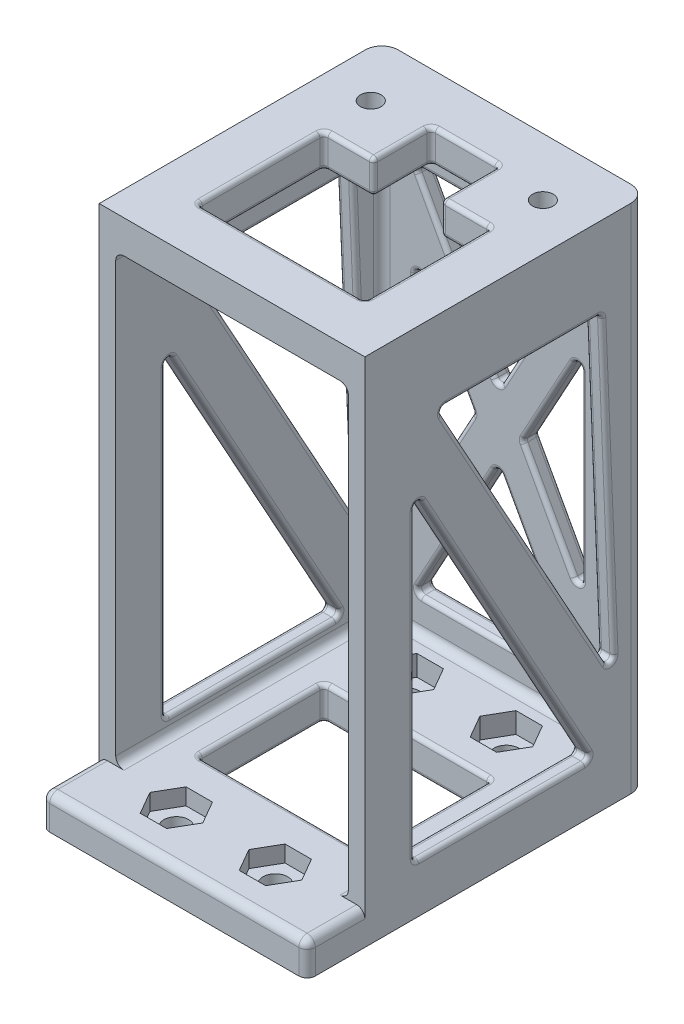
from build123d import *

# Parameters (mm, degrees)
SKETCH1_W           = 32.2
SKETCH1_H           = 34.25
BOSS_EXTRUDE1_DEPTH = 4
SKETCH5_W           = 32.2
SKETCH5_H           = 34.25
BOSS_EXTRUDE2_DEPTH = 4
SKETCH11_W          = 34.25
SKETCH11_H          = 54
BOSS_EXTRUDE3_DEPTH = 2
CUT_EXTRUDE1_REACH  = 79.807
LPATTERN1_COUNT     = 2
LPATTERN1_PITCH     = 30.2
CUT_EXTRUDE3_REACH  = 79.807
CUT_EXTRUDE4_REACH  = 79.807
BOSS_EXTRUDE5_REACH = 79.001
SKETCH18_W          = 2
SKETCH18_H          = 54
CUT_EXTRUDE5_REACH  = 79.807
FILLET9_R           = 0.5
FILLET10_R          = 1
FILLET11_R          = 2
SKETCH20_R          = 1.5
CUT_EXTRUDE6_DEPTH  = 10
CUT_EXTRUDE7_REACH  = 79.807
SKETCH21_R          = 1.25
CUT_EXTRUDE8_DEPTH  = 2.5
SKETCH24_W          = 32.2
SKETCH24_H          = 7
BOSS_EXTRUDE6_DEPTH = 4
CUT_EXTRUDE9_REACH  = 79.807
SKETCH25_R          = 1.5
CUT_EXTRUDE10_DEPTH = 2
FILLET12_R          = 1


with BuildPart() as part:
    # Sketch1 → Boss-Extrude1 (new body)
    with BuildSketch(Plane(origin=(0, 0, 0), x_dir=(1, 0, 0), z_dir=(0, 1, 0))):
        with Locations((16.1, 17.125)):
            Rectangle(SKETCH1_W, SKETCH1_H)
    extrude(amount=BOSS_EXTRUDE1_DEPTH)



with BuildPart() as body_2:
    # Sketch5 → Boss-Extrude2 (new body)
    with BuildSketch(Plane(origin=(0, 58, 0), x_dir=(1, 0, 0), z_dir=(0, 1, 0))):
        with Locations((16.1, 17.125)):
            Rectangle(SKETCH5_W, SKETCH5_H)
    extrude(amount=BOSS_EXTRUDE2_DEPTH)


with BuildPart() as part_1:
    add(part.part)

    add(body_2.part)  # Boss-Extrude3 merges body 2
    # Sketch11 → Boss-Extrude3 (add)
    with BuildSketch(Plane.ZY):
        with Locations((-17.125, 31)):
            Rectangle(SKETCH11_W, SKETCH11_H)
    boss_extrude3 = extrude(amount=-BOSS_EXTRUDE3_DEPTH)

    # Sketch13 → Cut-Extrude1 (cut, up to next)
    with BuildSketch(Plane.ZY, mode=Mode.PRIVATE) as cut_extrude1_sk1:
        Polygon((-28.692392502, 52), (-8.951510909, 52), (-30.28341197, 13.384587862), align=None)
    cut_extrude1_tool1 = extrude(cut_extrude1_sk1.sketch, amount=-CUT_EXTRUDE1_REACH, mode=Mode.PRIVATE) & part_1.part
    # Sketch13 → Cut-Extrude1 (cut, up to next)
    with BuildSketch(Plane.ZY, mode=Mode.PRIVATE) as cut_extrude1_sk2:
        Polygon((-6, 44.934491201), (-6, 6), (-27.50816651, 6), align=None)
    cut_extrude1_tool2 = extrude(cut_extrude1_sk2.sketch, amount=-CUT_EXTRUDE1_REACH, mode=Mode.PRIVATE) & part_1.part
    cut_extrude1_1 = cut_extrude1_tool1.solids().sort_by_distance((0, 39.128196, -22.642438))[0]
    add(cut_extrude1_1, mode=Mode.SUBTRACT)
    cut_extrude1_2 = cut_extrude1_tool2.solids().sort_by_distance((0, 18.978164, -13.169389))[0]
    add(cut_extrude1_2, mode=Mode.SUBTRACT)
    cut_extrude1 = cut_extrude1_1 + cut_extrude1_2  # Cut-Extrude1 as one shape, for the pattern or mirror that repeats it

    # LPattern1: Boss-Extrude3, Cut-Extrude1 ×2
    with Locations(*[(i * LPATTERN1_PITCH, 0, 0) for i in range(1, LPATTERN1_COUNT)]):
        add(boss_extrude3)
        add(cut_extrude1, mode=Mode.SUBTRACT)

    # Sketch16 → Cut-Extrude3 (cut, up to next)
    with BuildSketch(Plane(origin=(0, 62, 0), x_dir=(1, 0, 0), z_dir=(0, 1, 0)), mode=Mode.PRIVATE) as cut_extrude3_sk1:
        Polygon((12, 21.25), (6, 21.25), (6, 6), (26.2, 6), (26.2, 21.25), (20.2, 21.25), (20.2, 28.25), (12, 28.25), align=None)
    cut_extrude3_tool1 = extrude(cut_extrude3_sk1.sketch, amount=-CUT_EXTRUDE3_REACH, mode=Mode.PRIVATE) & part_1.part
    add(cut_extrude3_tool1.solids().sort_by_distance((16.1, 62, -15.372366))[0], mode=Mode.SUBTRACT)

    # Sketch17 → Cut-Extrude4 (cut, up to next)
    with BuildSketch(Plane.XZ, mode=Mode.PRIVATE) as cut_extrude4_sk1:
        Polygon((16.1, -21.25), (6, -21.25), (6, -6), (26.2, -6), (26.2, -21.25), align=None)
    cut_extrude4_tool1 = extrude(cut_extrude4_sk1.sketch, amount=-CUT_EXTRUDE4_REACH, mode=Mode.PRIVATE) & part_1.part
    add(cut_extrude4_tool1.solids().sort_by_distance((16.1, 0, -13.625))[0], mode=Mode.SUBTRACT)

    # Sketch18 → Boss-Extrude5 (add, up to next)
    with BuildSketch(Plane(origin=(2, 0, 0), x_dir=(0, 0, -1), z_dir=(1, 0, 0)), mode=Mode.PRIVATE) as boss_extrude5_sk1:
        with Locations((33.25, 31)):
            Rectangle(SKETCH18_W, SKETCH18_H)
    boss_extrude5_tool1 = extrude(boss_extrude5_sk1.sketch, amount=BOSS_EXTRUDE5_REACH, mode=Mode.PRIVATE) - part_1.part
    add(boss_extrude5_tool1.solids().sort_by_distance((2, 31, -33.25))[0])

    # Sketch19 → Cut-Extrude5 (cut, up to next)
    with BuildSketch(Plane(origin=(0, 0, -34.25), x_dir=(-1, 0, 0), z_dir=(0, 0, -1)), mode=Mode.PRIVATE) as cut_extrude5_sk1:
        Polygon((-26.2, 52.86920085), (-6, 52.86920085), (-16.1, 34.434600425), align=None)
    cut_extrude5_tool1 = extrude(cut_extrude5_sk1.sketch, amount=-CUT_EXTRUDE5_REACH, mode=Mode.PRIVATE) & part_1.part
    # Sketch19 → Cut-Extrude5 (cut, up to next)
    with BuildSketch(Plane(origin=(0, 0, -34.25), x_dir=(-1, 0, 0), z_dir=(0, 0, -1)), mode=Mode.PRIVATE) as cut_extrude5_sk2:
        Polygon((-16.1, 26.434600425), (-26.2, 8), (-6, 8), align=None)
    cut_extrude5_tool2 = extrude(cut_extrude5_sk2.sketch, amount=-CUT_EXTRUDE5_REACH, mode=Mode.PRIVATE) & part_1.part
    # Sketch19 → Cut-Extrude5 (cut, up to next)
    with BuildSketch(Plane(origin=(0, 0, -34.25), x_dir=(-1, 0, 0), z_dir=(0, 0, -1)), mode=Mode.PRIVATE) as cut_extrude5_sk3:
        Polygon((-6, 43.398410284), (-6, 17.470790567), (-13.102648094, 30.434600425), align=None)
    cut_extrude5_tool3 = extrude(cut_extrude5_sk3.sketch, amount=-CUT_EXTRUDE5_REACH, mode=Mode.PRIVATE) & part_1.part
    # Sketch19 → Cut-Extrude5 (cut, up to next)
    with BuildSketch(Plane(origin=(0, 0, -34.25), x_dir=(-1, 0, 0), z_dir=(0, 0, -1)), mode=Mode.PRIVATE) as cut_extrude5_sk4:
        Polygon((-26.2, 43.398410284), (-19.097351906, 30.434600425), (-26.2, 17.470790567), align=None)
    cut_extrude5_tool4 = extrude(cut_extrude5_sk4.sketch, amount=-CUT_EXTRUDE5_REACH, mode=Mode.PRIVATE) & part_1.part
    add(cut_extrude5_tool1.solids().sort_by_distance((16.1, 46.724334, -34.25))[0], mode=Mode.SUBTRACT)
    add(cut_extrude5_tool2.solids().sort_by_distance((16.1, 14.144867, -34.25))[0], mode=Mode.SUBTRACT)
    add(cut_extrude5_tool3.solids().sort_by_distance((8.367549, 30.4346, -34.25))[0], mode=Mode.SUBTRACT)
    add(cut_extrude5_tool4.solids().sort_by_distance((23.832451, 30.4346, -34.25))[0], mode=Mode.SUBTRACT)

    # Fillet9
    fillet9_edges = [part_1.edges().sort_by_distance(p)[0] for p in [
        (26.2, 60, -21.25),
        (26.2, 60, -6),
        (6, 60, -6),
        (6, 60, -21.25),
        (12, 60, -21.25),
        (12, 60, -28.25),
        (20.2, 60, -28.25),
        (20.2, 60, -21.25),
        (26.2, 62, -13.625),
        (23.2, 62, -21.25),
        (20.2, 62, -24.75),
        (16.1, 62, -28.25),
        (12, 62, -24.75),
        (9, 62, -21.25),
        (6, 62, -13.625),
        (16.1, 62, -6),
        (23.2, 58, -21.25),
        (26.2, 58, -13.625),
        (16.1, 58, -6),
        (6, 58, -13.625),
        (9, 58, -21.25),
        (12, 58, -24.75),
        (16.1, 58, -28.25),
        (20.2, 58, -24.75),
        (16.1, 4, -6),
        (26.2, 4, -13.625),
        (16.1, 4, -21.25),
        (6, 4, -13.625),
        (26.2, 2, -6),
        (26.2, 2, -21.25),
        (6, 2, -21.25),
        (6, 2, -6),
        (26.2, 0, -13.625),
        (16.1, 0, -6),
        (6, 0, -13.625),
        (16.1, 0, -21.25),
        (13.102648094, 30.434600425, -33.25),
        (6, 43.398410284, -33.25),
        (6, 17.470790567, -33.25),
        (9.551324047, 36.916505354, -34.25),
        (9.551324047, 23.952695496, -34.25),
        (6, 30.434600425, -34.25),
        (9.551324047, 23.952695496, -32.25),
        (9.551324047, 36.916505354, -32.25),
        (6, 30.434600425, -32.25),
        (16.1, 26.434600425, -33.25),
        (6, 8, -33.25),
        (26.2, 8, -33.25),
        (11.05, 17.217300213, -34.25),
        (21.15, 17.217300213, -34.25),
        (16.1, 8, -34.25),
        (21.15, 17.217300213, -32.25),
        (11.05, 17.217300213, -32.25),
        (16.1, 8, -32.25),
        (26.2, 17.470790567, -33.25),
        (26.2, 43.398410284, -33.25),
        (19.097351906, 30.434600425, -33.25),
        (26.2, 30.434600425, -34.25),
        (22.648675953, 23.952695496, -34.25),
        (22.648675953, 36.916505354, -34.25),
        (22.648675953, 23.952695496, -32.25),
        (26.2, 30.434600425, -32.25),
        (22.648675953, 36.916505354, -32.25),
        (16.1, 34.434600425, -33.25),
        (26.2, 52.86920085, -33.25),
        (6, 52.86920085, -33.25),
        (21.15, 43.651900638, -34.25),
        (11.05, 43.651900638, -34.25),
        (16.1, 52.86920085, -34.25),
        (11.05, 43.651900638, -32.25),
        (21.15, 43.651900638, -32.25),
        (16.1, 52.86920085, -32.25),
        (2, 6, -16.754083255),
        (1, 6, -6),
        (2, 25.4672456, -16.754083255),
        (1, 6, -27.50816651),
        (2, 25.4672456, -6),
        (1, 44.934491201, -6),
        (0, 6, -16.754083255),
        (0, 25.4672456, -6),
        (0, 25.4672456, -16.754083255),
        (2, 32.692293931, -29.487902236),
        (1, 13.384587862, -30.28341197),
        (2, 52, -18.821951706),
        (1, 52, -28.692392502),
        (2, 32.692293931, -19.617461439),
        (1, 52, -8.951510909),
        (0, 32.692293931, -29.487902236),
        (0, 32.692293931, -19.617461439),
        (0, 52, -18.821951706),
        (31.2, 6, -6),
        (31.2, 6, -27.50816651),
        (31.2, 44.934491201, -6),
        (30.2, 6, -16.754083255),
        (30.2, 25.4672456, -6),
        (30.2, 25.4672456, -16.754083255),
        (32.2, 25.4672456, -6),
        (32.2, 6, -16.754083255),
        (32.2, 25.4672456, -16.754083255),
        (31.2, 13.384587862, -30.28341197),
        (31.2, 52, -28.692392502),
        (31.2, 52, -8.951510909),
        (30.2, 32.692293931, -29.487902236),
        (30.2, 32.692293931, -19.617461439),
        (30.2, 52, -18.821951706),
        (32.2, 32.692293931, -19.617461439),
        (32.2, 32.692293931, -29.487902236),
        (32.2, 52, -18.821951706),
    ]]
    fillet(fillet9_edges, radius=FILLET9_R)

    # Fillet10
    fillet10_edges = [part_1.edges().sort_by_distance(p)[0] for p in [
        (30.2, 4, -16.125),
        (2, 4, -16.125),
        (30.2, 31, -32.25),
        (16.1, 4, -32.25),
        (16.1, 58, -32.25),
        (2, 31, -32.25),
        (2, 58, -16.125),
        (30.2, 58, -16.125),
    ]]
    fillet(fillet10_edges, radius=FILLET10_R)

    # Fillet11
    fillet11_edges = [part_1.edges().sort_by_distance(p)[0] for p in [
        (0, 31, -34.25),
        (32.2, 31, -34.25),
    ]]
    fillet(fillet11_edges, radius=FILLET11_R)

    # Sketch20 → Cut-Extrude6 (cut)
    with BuildSketch(Plane(origin=(0, 4, 0), x_dir=(1, 0, 0), z_dir=(0, 1, 0))):
        with Locations(Location((10.1, 27.25, 0), (0, 0, 270))):
            Circle(SKETCH20_R)
        with Locations(Location((22.1, 27.25, 0), (0, 0, 270))):
            Circle(SKETCH20_R)
    extrude(amount=-CUT_EXTRUDE6_DEPTH, mode=Mode.SUBTRACT)

    # Sketch21 → Cut-Extrude7 (cut, up to next)
    with BuildSketch(Plane(origin=(0, 62, 0), x_dir=(1, 0, 0), z_dir=(0, 1, 0)), mode=Mode.PRIVATE) as cut_extrude7_sk1:
        with Locations(Location((5.67, 27.25, 0), (0, 0, 270))):
            Circle(SKETCH21_R)
    cut_extrude7_tool1 = extrude(cut_extrude7_sk1.sketch, amount=-CUT_EXTRUDE7_REACH, mode=Mode.PRIVATE) & part_1.part
    # Sketch21 → Cut-Extrude7 (cut, up to next)
    with BuildSketch(Plane(origin=(0, 62, 0), x_dir=(1, 0, 0), z_dir=(0, 1, 0)), mode=Mode.PRIVATE) as cut_extrude7_sk2:
        with Locations(Location((26.53, 27.25, 0), (0, 0, 270))):
            Circle(SKETCH21_R)
    cut_extrude7_tool2 = extrude(cut_extrude7_sk2.sketch, amount=-CUT_EXTRUDE7_REACH, mode=Mode.PRIVATE) & part_1.part
    add(cut_extrude7_tool1.solids().sort_by_distance((5.67, 62, -27.25))[0], mode=Mode.SUBTRACT)
    add(cut_extrude7_tool2.solids().sort_by_distance((26.53, 62, -27.25))[0], mode=Mode.SUBTRACT)

    # Sketch22 → Cut-Extrude8 (cut)
    with BuildSketch(Plane(origin=(0, 4, 0), x_dir=(1, 0, 0), z_dir=(0, 1, 0))):
        Polygon((13.304293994, 27.25), (11.702146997, 30.025), (8.497853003, 30.025), (6.895706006, 27.25), (8.497853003, 24.475), (11.702146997, 24.475), align=None)
        Polygon((18.895706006, 27.25), (20.497853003, 24.475), (23.702146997, 24.475), (25.304293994, 27.25), (23.702146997, 30.025), (20.497853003, 30.025), align=None)
    extrude(amount=-CUT_EXTRUDE8_DEPTH, mode=Mode.SUBTRACT)

    # Sketch24 → Boss-Extrude6 (add)
    with BuildSketch(Plane.XZ):
        with Locations((16.1, 3.5)):
            Rectangle(SKETCH24_W, SKETCH24_H)
    extrude(amount=-BOSS_EXTRUDE6_DEPTH)

    # Sketch25 → Cut-Extrude9 (cut, up to next)
    with BuildSketch(Plane.XZ, mode=Mode.PRIVATE) as cut_extrude9_sk1:
        with Locations(Location((10.1, 0.75, 0), (0, 0, 270))):
            Circle(SKETCH25_R)
    cut_extrude9_tool1 = extrude(cut_extrude9_sk1.sketch, amount=-CUT_EXTRUDE9_REACH, mode=Mode.PRIVATE) & part_1.part
    # Sketch25 → Cut-Extrude9 (cut, up to next)
    with BuildSketch(Plane.XZ, mode=Mode.PRIVATE) as cut_extrude9_sk2:
        with Locations(Location((22.1, 0.75, 0), (0, 0, 270))):
            Circle(SKETCH25_R)
    cut_extrude9_tool2 = extrude(cut_extrude9_sk2.sketch, amount=-CUT_EXTRUDE9_REACH, mode=Mode.PRIVATE) & part_1.part
    add(cut_extrude9_tool1.solids().sort_by_distance((10.1, 0, 0.75))[0], mode=Mode.SUBTRACT)
    add(cut_extrude9_tool2.solids().sort_by_distance((22.1, 0, 0.75))[0], mode=Mode.SUBTRACT)

    # Sketch26 → Cut-Extrude10 (cut)
    with BuildSketch(Plane(origin=(0, 4, 0), x_dir=(1, 0, 0), z_dir=(0, 1, 0))):
        Polygon((13.304293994, -0.75), (11.702146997, 2.025), (8.497853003, 2.025), (6.895706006, -0.75), (8.497853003, -3.525), (11.702146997, -3.525), align=None)
        Polygon((25.304293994, -0.75), (23.702146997, 2.025), (20.497853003, 2.025), (18.895706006, -0.75), (20.497853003, -3.525), (23.702146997, -3.525), align=None)
    extrude(amount=-CUT_EXTRUDE10_DEPTH, mode=Mode.SUBTRACT)

    # Fillet12
    fillet12_edges = [part_1.edges().sort_by_distance(p)[0] for p in [
        (0, 4, 3.5),
        (16.1, 4, 7),
        (0, 2, 7),
        (32.2, 4, 3.5),
        (32.2, 2, 7),
    ]]
    fillet(fillet12_edges, radius=FILLET12_R)


solid = part_1.part
